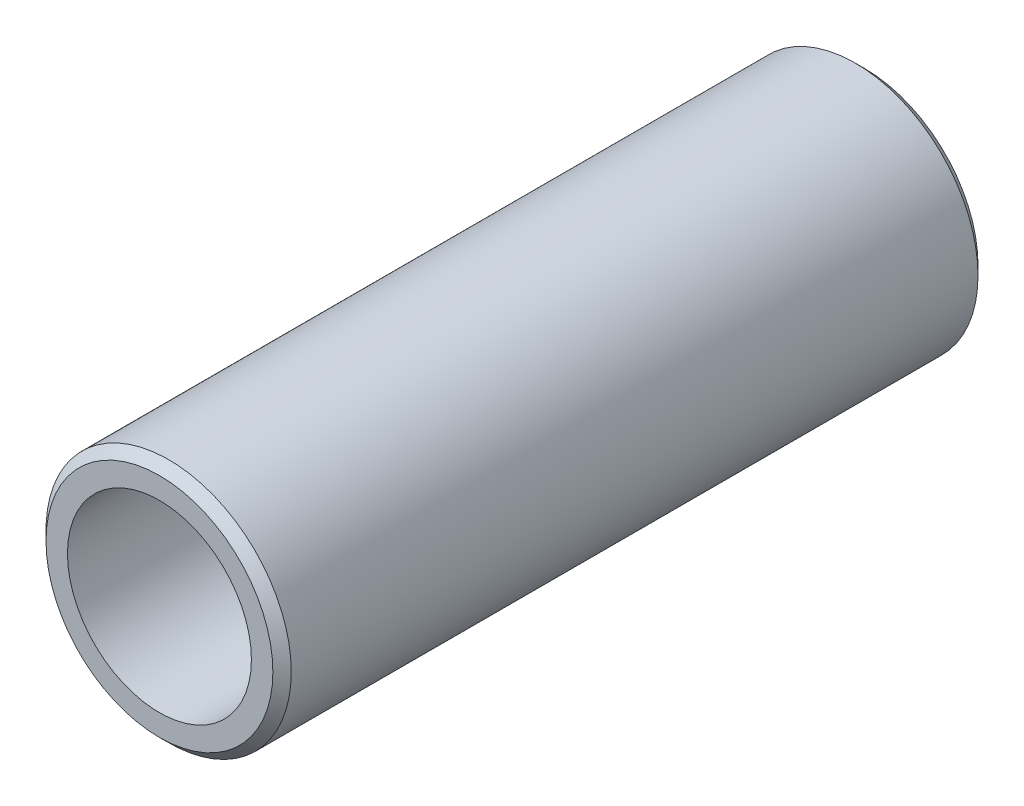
from build123d import *

# Parameters (mm, degrees)
ESQUISSE1_R             = 4
EXTRUSION1_DEPTH        = 23
ESQUISSE2_R             = 3
ENL_V_MAT_EXTRU_1_DEPTH = 23
CHANFREIN2_SIZE         = 0.3


with BuildPart() as part:
    # Esquisse1 → Extrusion1 (new body)
    with BuildSketch(Plane.XY):
        Circle(ESQUISSE1_R)
    extrude(amount=-EXTRUSION1_DEPTH)

    # Esquisse2 → Enl_v. mat.-Extru.1 (cut)
    with BuildSketch(Plane.XY):
        Circle(ESQUISSE2_R)
    extrude(amount=-ENL_V_MAT_EXTRU_1_DEPTH, mode=Mode.SUBTRACT)

    # Chanfrein2
    chanfrein2_edges = [part.edges().sort_by_distance(p)[0] for p in [
        (-4, 0, 0),
        (-4, 0, -23),
    ]]
    chamfer(chanfrein2_edges, length=CHANFREIN2_SIZE)


solid = part.part
